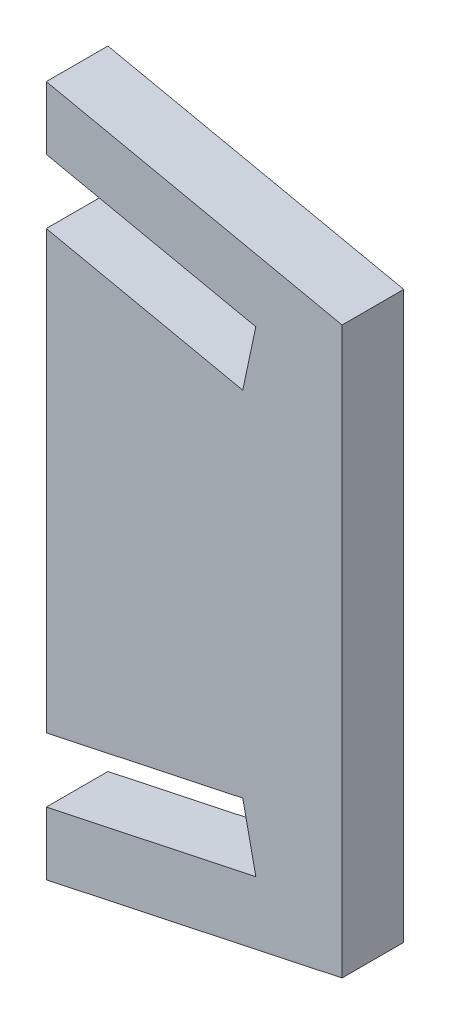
ISO-10303-21;
HEADER;
FILE_DESCRIPTION(('STEP AP214'),'2;1');
FILE_NAME('part.step','',(''),(''),'','','');
FILE_SCHEMA(('AUTOMOTIVE_DESIGN { 1 0 10303 214 1 1 1 1 }'));
ENDSEC;
DATA;
#1=APPLICATION_CONTEXT('core data for automotive mechanical design processes');
#2=APPLICATION_PROTOCOL_DEFINITION('international standard','automotive_design',2000,#1);
#3=PRODUCT_CONTEXT('',#1,'mechanical');
#4=PRODUCT('Part','Part','',(#3));
#5=PRODUCT_RELATED_PRODUCT_CATEGORY('part','',(#4));
#6=PRODUCT_DEFINITION_FORMATION('','',#4);
#7=PRODUCT_DEFINITION_CONTEXT('part definition',#1,'design');
#8=PRODUCT_DEFINITION('design','',#6,#7);
#9=PRODUCT_DEFINITION_SHAPE('','',#8);
#10=(LENGTH_UNIT() NAMED_UNIT(*) SI_UNIT(.MILLI.,.METRE.));
#11=(NAMED_UNIT(*) PLANE_ANGLE_UNIT() SI_UNIT($,.RADIAN.));
#12=(NAMED_UNIT(*) SI_UNIT($,.STERADIAN.) SOLID_ANGLE_UNIT());
#13=UNCERTAINTY_MEASURE_WITH_UNIT(LENGTH_MEASURE(1.E-05),#10,'distance_accuracy_value','');
#14=(GEOMETRIC_REPRESENTATION_CONTEXT(3) GLOBAL_UNCERTAINTY_ASSIGNED_CONTEXT((#13)) GLOBAL_UNIT_ASSIGNED_CONTEXT((#10,
#11,#12)) REPRESENTATION_CONTEXT('',''));
#15=CARTESIAN_POINT('',(0.,0.,0.));
#16=DIRECTION('',(0.,0.,1.));
#17=DIRECTION('',(1.,0.,0.));
#18=AXIS2_PLACEMENT_3D('',#15,#16,#17);
#19=CARTESIAN_POINT('',(-48.,0.,10.));
#20=DIRECTION('',(1.,0.,0.));
#21=DIRECTION('',(0.,0.,-1.));
#22=AXIS2_PLACEMENT_3D('',#19,#20,#21);
#23=PLANE('',#22);
#24=DIRECTION('',(0.,-1.,0.));
#25=VECTOR('',#24,1.);
#26=CARTESIAN_POINT('',(-48.,0.,10.));
#27=LINE('',#26,#25);
#28=CARTESIAN_POINT('',(-48.,121.087434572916,10.));
#29=VERTEX_POINT('',#28);
#30=CARTESIAN_POINT('',(-48.,110.864028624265,10.));
#31=VERTEX_POINT('',#30);
#32=EDGE_CURVE('E41',#29,#31,#27,.T.);
#33=ORIENTED_EDGE('',*,*,#32,.F.);
#34=DIRECTION('',(0.,0.,-1.));
#35=VECTOR('',#34,1.);
#36=CARTESIAN_POINT('',(-48.,121.087434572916,10.));
#37=LINE('',#36,#35);
#38=CARTESIAN_POINT('',(-48.,121.087434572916,0.));
#39=VERTEX_POINT('',#38);
#40=EDGE_CURVE('E122',#29,#39,#37,.T.);
#41=ORIENTED_EDGE('',*,*,#40,.T.);
#42=DIRECTION('',(0.,-1.,0.));
#43=VECTOR('',#42,1.);
#44=CARTESIAN_POINT('',(-48.,0.,0.));
#45=LINE('',#44,#43);
#46=CARTESIAN_POINT('',(-48.,110.864028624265,0.));
#47=VERTEX_POINT('',#46);
#48=EDGE_CURVE('E141',#39,#47,#45,.T.);
#49=ORIENTED_EDGE('',*,*,#48,.T.);
#50=DIRECTION('',(0.,0.,1.));
#51=VECTOR('',#50,1.);
#52=CARTESIAN_POINT('',(-48.,110.864028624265,0.));
#53=LINE('',#52,#51);
#54=EDGE_CURVE('E151',#47,#31,#53,.T.);
#55=ORIENTED_EDGE('',*,*,#54,.T.);
#56=EDGE_LOOP('',(#33,#41,#49,#55));
#57=FACE_BOUND('',#56,.T.);
#58=ADVANCED_FACE('F33',(#57),#23,.F.);
#59=CARTESIAN_POINT('',(-48.,100.436154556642,10.));
#60=VERTEX_POINT('',#59);
#61=CARTESIAN_POINT('',(-48.,29.563845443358,10.));
#62=VERTEX_POINT('',#61);
#63=EDGE_CURVE('E143',#60,#62,#27,.T.);
#64=ORIENTED_EDGE('',*,*,#63,.F.);
#65=DIRECTION('',(0.,0.,1.));
#66=VECTOR('',#65,1.);
#67=CARTESIAN_POINT('',(-48.,100.436154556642,0.));
#68=LINE('',#67,#66);
#69=CARTESIAN_POINT('',(-48.,100.436154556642,0.));
#70=VERTEX_POINT('',#69);
#71=EDGE_CURVE('E165',#70,#60,#68,.T.);
#72=ORIENTED_EDGE('',*,*,#71,.F.);
#73=CARTESIAN_POINT('',(-48.,29.563845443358,0.));
#74=VERTEX_POINT('',#73);
#75=EDGE_CURVE('E145',#70,#74,#45,.T.);
#76=ORIENTED_EDGE('',*,*,#75,.T.);
#77=DIRECTION('',(0.,0.,1.));
#78=VECTOR('',#77,1.);
#79=CARTESIAN_POINT('',(-48.,29.563845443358,0.));
#80=LINE('',#79,#78);
#81=EDGE_CURVE('E148',#74,#62,#80,.T.);
#82=ORIENTED_EDGE('',*,*,#81,.T.);
#83=EDGE_LOOP('',(#64,#72,#76,#82));
#84=FACE_BOUND('',#83,.T.);
#85=ADVANCED_FACE('F198',(#84),#23,.F.);
#86=CARTESIAN_POINT('',(0.,0.,10.));
#87=DIRECTION('',(-1.,0.,0.));
#88=DIRECTION('',(0.,-1.,0.));
#89=AXIS2_PLACEMENT_3D('',#86,#87,#88);
#90=PLANE('',#89);
#91=DIRECTION('',(0.,1.,0.));
#92=VECTOR('',#91,1.);
#93=CARTESIAN_POINT('',(0.,0.,0.));
#94=LINE('',#93,#92);
#95=CARTESIAN_POINT('',(0.,19.1152803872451,0.));
#96=VERTEX_POINT('',#95);
#97=CARTESIAN_POINT('',(0.,110.884719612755,0.));
#98=VERTEX_POINT('',#97);
#99=EDGE_CURVE('E134',#96,#98,#94,.T.);
#100=ORIENTED_EDGE('',*,*,#99,.T.);
#101=DIRECTION('',(0.,0.,1.));
#102=VECTOR('',#101,1.);
#103=CARTESIAN_POINT('',(0.,110.884719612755,0.));
#104=LINE('',#103,#102);
#105=CARTESIAN_POINT('',(0.,110.884719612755,10.));
#106=VERTEX_POINT('',#105);
#107=EDGE_CURVE('E56',#98,#106,#104,.T.);
#108=ORIENTED_EDGE('',*,*,#107,.T.);
#109=DIRECTION('',(0.,1.,0.));
#110=VECTOR('',#109,1.);
#111=CARTESIAN_POINT('',(0.,0.,10.));
#112=LINE('',#111,#110);
#113=CARTESIAN_POINT('',(0.,19.1152803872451,10.));
#114=VERTEX_POINT('',#113);
#115=EDGE_CURVE('E132',#114,#106,#112,.T.);
#116=ORIENTED_EDGE('',*,*,#115,.F.);
#117=DIRECTION('',(0.,0.,1.));
#118=VECTOR('',#117,1.);
#119=CARTESIAN_POINT('',(0.,19.1152803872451,0.));
#120=LINE('',#119,#118);
#121=EDGE_CURVE('E126',#96,#114,#120,.T.);
#122=ORIENTED_EDGE('',*,*,#121,.F.);
#123=EDGE_LOOP('',(#100,#108,#116,#122));
#124=FACE_BOUND('',#123,.T.);
#125=ADVANCED_FACE('F35',(#124),#90,.F.);
#126=CARTESIAN_POINT('',(-48.,19.1359713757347,0.));
#127=VERTEX_POINT('',#126);
#128=CARTESIAN_POINT('',(-48.,8.91256542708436,0.));
#129=VERTEX_POINT('',#128);
#130=EDGE_CURVE('E146',#127,#129,#45,.T.);
#131=ORIENTED_EDGE('',*,*,#130,.T.);
#132=DIRECTION('',(0.,0.,1.));
#133=VECTOR('',#132,1.);
#134=CARTESIAN_POINT('',(-48.,8.91256542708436,10.));
#135=LINE('',#134,#133);
#136=CARTESIAN_POINT('',(-48.,8.91256542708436,10.));
#137=VERTEX_POINT('',#136);
#138=EDGE_CURVE('E48',#129,#137,#135,.T.);
#139=ORIENTED_EDGE('',*,*,#138,.T.);
#140=CARTESIAN_POINT('',(-48.,19.1359713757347,10.));
#141=VERTEX_POINT('',#140);
#142=EDGE_CURVE('E140',#141,#137,#27,.T.);
#143=ORIENTED_EDGE('',*,*,#142,.F.);
#144=DIRECTION('',(0.,0.,1.));
#145=VECTOR('',#144,1.);
#146=CARTESIAN_POINT('',(-48.,19.1359713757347,0.));
#147=LINE('',#146,#145);
#148=EDGE_CURVE('E189',#127,#141,#147,.T.);
#149=ORIENTED_EDGE('',*,*,#148,.F.);
#150=EDGE_LOOP('',(#131,#139,#143,#149));
#151=FACE_BOUND('',#150,.T.);
#152=ADVANCED_FACE('F233',(#151),#23,.F.);
#153=CARTESIAN_POINT('',(0.,0.,10.));
#154=DIRECTION('',(0.,0.,1.));
#155=DIRECTION('',(1.,0.,0.));
#156=AXIS2_PLACEMENT_3D('',#153,#154,#155);
#157=PLANE('',#156);
#158=DIRECTION('',(0.978147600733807,-0.207911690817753,0.));
#159=VECTOR('',#158,1.);
#160=CARTESIAN_POINT('',(-89.9303236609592,130.,10.));
#161=LINE('',#160,#159);
#162=EDGE_CURVE('E119',#29,#106,#161,.T.);
#163=ORIENTED_EDGE('',*,*,#162,.F.);
#164=ORIENTED_EDGE('',*,*,#32,.T.);
#165=DIRECTION('',(-0.978147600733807,0.207911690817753,0.));
#166=VECTOR('',#165,1.);
#167=CARTESIAN_POINT('',(-48.,110.864028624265,10.));
#168=LINE('',#167,#166);
#169=CARTESIAN_POINT('',(-14.,103.637105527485,10.));
#170=VERTEX_POINT('',#169);
#171=EDGE_CURVE('E161',#170,#31,#168,.T.);
#172=ORIENTED_EDGE('',*,*,#171,.F.);
#173=DIRECTION('',(0.207911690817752,0.978147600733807,0.));
#174=VECTOR('',#173,1.);
#175=CARTESIAN_POINT('',(-14.,103.637105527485,10.));
#176=LINE('',#175,#174);
#177=CARTESIAN_POINT('',(-16.1206992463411,93.66,10.));
#178=VERTEX_POINT('',#177);
#179=EDGE_CURVE('E210',#178,#170,#176,.T.);
#180=ORIENTED_EDGE('',*,*,#179,.F.);
#181=DIRECTION('',(0.978147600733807,-0.207911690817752,0.));
#182=VECTOR('',#181,1.);
#183=CARTESIAN_POINT('',(-16.1206992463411,93.66,10.));
#184=LINE('',#183,#182);
#185=EDGE_CURVE('E187',#60,#178,#184,.T.);
#186=ORIENTED_EDGE('',*,*,#185,.F.);
#187=ORIENTED_EDGE('',*,*,#63,.T.);
#188=DIRECTION('',(-0.978147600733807,-0.207911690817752,0.));
#189=VECTOR('',#188,1.);
#190=CARTESIAN_POINT('',(-16.1206992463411,36.34,10.));
#191=LINE('',#190,#189);
#192=CARTESIAN_POINT('',(-16.1206992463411,36.34,10.));
#193=VERTEX_POINT('',#192);
#194=EDGE_CURVE('E178',#193,#62,#191,.T.);
#195=ORIENTED_EDGE('',*,*,#194,.F.);
#196=DIRECTION('',(-0.207911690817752,0.978147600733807,0.));
#197=VECTOR('',#196,1.);
#198=CARTESIAN_POINT('',(-14.,26.3628944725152,10.));
#199=LINE('',#198,#197);
#200=CARTESIAN_POINT('',(-14.,26.3628944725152,10.));
#201=VERTEX_POINT('',#200);
#202=EDGE_CURVE('E172',#201,#193,#199,.T.);
#203=ORIENTED_EDGE('',*,*,#202,.F.);
#204=DIRECTION('',(0.978147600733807,0.207911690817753,0.));
#205=VECTOR('',#204,1.);
#206=CARTESIAN_POINT('',(-48.,19.1359713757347,10.));
#207=LINE('',#206,#205);
#208=EDGE_CURVE('E180',#141,#201,#207,.T.);
#209=ORIENTED_EDGE('',*,*,#208,.F.);
#210=ORIENTED_EDGE('',*,*,#142,.T.);
#211=DIRECTION('',(-0.978147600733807,-0.207911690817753,0.));
#212=VECTOR('',#211,1.);
#213=CARTESIAN_POINT('',(-89.9303236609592,0.,10.));
#214=LINE('',#213,#212);
#215=EDGE_CURVE('E139',#114,#137,#214,.T.);
#216=ORIENTED_EDGE('',*,*,#215,.F.);
#217=ORIENTED_EDGE('',*,*,#115,.T.);
#218=EDGE_LOOP('',(#163,#164,#172,#180,#186,#187,#195,#203,#209,#210,#216,#217));
#219=FACE_BOUND('',#218,.T.);
#220=ADVANCED_FACE('F137',(#219),#157,.T.);
#221=CARTESIAN_POINT('',(0.,0.,0.));
#222=DIRECTION('',(0.,0.,1.));
#223=DIRECTION('',(1.,0.,0.));
#224=AXIS2_PLACEMENT_3D('',#221,#222,#223);
#225=PLANE('',#224);
#226=ORIENTED_EDGE('',*,*,#48,.F.);
#227=DIRECTION('',(0.978147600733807,-0.207911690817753,0.));
#228=VECTOR('',#227,1.);
#229=CARTESIAN_POINT('',(22.5504393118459,106.091475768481,0.));
#230=LINE('',#229,#228);
#231=EDGE_CURVE('E11',#39,#98,#230,.T.);
#232=ORIENTED_EDGE('',*,*,#231,.T.);
#233=ORIENTED_EDGE('',*,*,#99,.F.);
#234=DIRECTION('',(-0.978147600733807,-0.207911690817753,0.));
#235=VECTOR('',#234,1.);
#236=CARTESIAN_POINT('',(-89.9303236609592,0.,0.));
#237=LINE('',#236,#235);
#238=EDGE_CURVE('E226',#96,#129,#237,.T.);
#239=ORIENTED_EDGE('',*,*,#238,.T.);
#240=ORIENTED_EDGE('',*,*,#130,.F.);
#241=DIRECTION('',(0.978147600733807,0.207911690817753,0.));
#242=VECTOR('',#241,1.);
#243=CARTESIAN_POINT('',(-48.,19.1359713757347,0.));
#244=LINE('',#243,#242);
#245=CARTESIAN_POINT('',(-14.,26.3628944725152,0.));
#246=VERTEX_POINT('',#245);
#247=EDGE_CURVE('E171',#127,#246,#244,.T.);
#248=ORIENTED_EDGE('',*,*,#247,.T.);
#249=DIRECTION('',(-0.207911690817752,0.978147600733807,0.));
#250=VECTOR('',#249,1.);
#251=CARTESIAN_POINT('',(-14.,26.3628944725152,0.));
#252=LINE('',#251,#250);
#253=CARTESIAN_POINT('',(-16.1206992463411,36.34,0.));
#254=VERTEX_POINT('',#253);
#255=EDGE_CURVE('E175',#246,#254,#252,.T.);
#256=ORIENTED_EDGE('',*,*,#255,.T.);
#257=DIRECTION('',(-0.978147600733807,-0.207911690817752,0.));
#258=VECTOR('',#257,1.);
#259=CARTESIAN_POINT('',(-16.1206992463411,36.34,0.));
#260=LINE('',#259,#258);
#261=EDGE_CURVE('E168',#254,#74,#260,.T.);
#262=ORIENTED_EDGE('',*,*,#261,.T.);
#263=ORIENTED_EDGE('',*,*,#75,.F.);
#264=DIRECTION('',(0.978147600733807,-0.207911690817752,0.));
#265=VECTOR('',#264,1.);
#266=CARTESIAN_POINT('',(-16.1206992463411,93.66,0.));
#267=LINE('',#266,#265);
#268=CARTESIAN_POINT('',(-16.1206992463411,93.66,0.));
#269=VERTEX_POINT('',#268);
#270=EDGE_CURVE('E220',#70,#269,#267,.T.);
#271=ORIENTED_EDGE('',*,*,#270,.T.);
#272=DIRECTION('',(0.207911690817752,0.978147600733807,0.));
#273=VECTOR('',#272,1.);
#274=CARTESIAN_POINT('',(-14.,103.637105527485,0.));
#275=LINE('',#274,#273);
#276=CARTESIAN_POINT('',(-14.,103.637105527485,0.));
#277=VERTEX_POINT('',#276);
#278=EDGE_CURVE('E217',#269,#277,#275,.T.);
#279=ORIENTED_EDGE('',*,*,#278,.T.);
#280=DIRECTION('',(-0.978147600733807,0.207911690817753,0.));
#281=VECTOR('',#280,1.);
#282=CARTESIAN_POINT('',(-48.,110.864028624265,0.));
#283=LINE('',#282,#281);
#284=EDGE_CURVE('E167',#277,#47,#283,.T.);
#285=ORIENTED_EDGE('',*,*,#284,.T.);
#286=EDGE_LOOP('',(#226,#232,#233,#239,#240,#248,#256,#262,#263,#271,#279,#285));
#287=FACE_BOUND('',#286,.T.);
#288=ADVANCED_FACE('F231',(#287),#225,.F.);
#289=CARTESIAN_POINT('',(-16.1206992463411,36.34,0.));
#290=DIRECTION('',(-0.207911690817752,0.978147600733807,0.));
#291=DIRECTION('',(-0.978147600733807,-0.207911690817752,0.));
#292=AXIS2_PLACEMENT_3D('',#289,#290,#291);
#293=PLANE('',#292);
#294=ORIENTED_EDGE('',*,*,#194,.T.);
#295=ORIENTED_EDGE('',*,*,#81,.F.);
#296=ORIENTED_EDGE('',*,*,#261,.F.);
#297=DIRECTION('',(0.,0.,1.));
#298=VECTOR('',#297,1.);
#299=CARTESIAN_POINT('',(-16.1206992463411,36.34,0.));
#300=LINE('',#299,#298);
#301=EDGE_CURVE('E185',#254,#193,#300,.T.);
#302=ORIENTED_EDGE('',*,*,#301,.T.);
#303=EDGE_LOOP('',(#294,#295,#296,#302));
#304=FACE_BOUND('',#303,.T.);
#305=ADVANCED_FACE('F239',(#304),#293,.F.);
#306=CARTESIAN_POINT('',(-14.,26.3628944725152,0.));
#307=DIRECTION('',(0.978147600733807,0.207911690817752,0.));
#308=DIRECTION('',(-0.207911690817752,0.978147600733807,0.));
#309=AXIS2_PLACEMENT_3D('',#306,#307,#308);
#310=PLANE('',#309);
#311=ORIENTED_EDGE('',*,*,#202,.T.);
#312=ORIENTED_EDGE('',*,*,#301,.F.);
#313=ORIENTED_EDGE('',*,*,#255,.F.);
#314=DIRECTION('',(0.,0.,1.));
#315=VECTOR('',#314,1.);
#316=CARTESIAN_POINT('',(-14.,26.3628944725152,0.));
#317=LINE('',#316,#315);
#318=EDGE_CURVE('E188',#246,#201,#317,.T.);
#319=ORIENTED_EDGE('',*,*,#318,.T.);
#320=EDGE_LOOP('',(#311,#312,#313,#319));
#321=FACE_BOUND('',#320,.T.);
#322=ADVANCED_FACE('F238',(#321),#310,.F.);
#323=CARTESIAN_POINT('',(-48.,19.1359713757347,0.));
#324=DIRECTION('',(0.207911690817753,-0.978147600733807,0.));
#325=DIRECTION('',(0.978147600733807,0.207911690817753,0.));
#326=AXIS2_PLACEMENT_3D('',#323,#324,#325);
#327=PLANE('',#326);
#328=ORIENTED_EDGE('',*,*,#208,.T.);
#329=ORIENTED_EDGE('',*,*,#318,.F.);
#330=ORIENTED_EDGE('',*,*,#247,.F.);
#331=ORIENTED_EDGE('',*,*,#148,.T.);
#332=EDGE_LOOP('',(#328,#329,#330,#331));
#333=FACE_BOUND('',#332,.T.);
#334=ADVANCED_FACE('F236',(#333),#327,.F.);
#335=CARTESIAN_POINT('',(-48.,110.864028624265,0.));
#336=DIRECTION('',(0.207911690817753,0.978147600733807,0.));
#337=DIRECTION('',(-0.978147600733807,0.207911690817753,0.));
#338=AXIS2_PLACEMENT_3D('',#335,#336,#337);
#339=PLANE('',#338);
#340=ORIENTED_EDGE('',*,*,#171,.T.);
#341=ORIENTED_EDGE('',*,*,#54,.F.);
#342=ORIENTED_EDGE('',*,*,#284,.F.);
#343=DIRECTION('',(0.,0.,1.));
#344=VECTOR('',#343,1.);
#345=CARTESIAN_POINT('',(-14.,103.637105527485,0.));
#346=LINE('',#345,#344);
#347=EDGE_CURVE('E154',#277,#170,#346,.T.);
#348=ORIENTED_EDGE('',*,*,#347,.T.);
#349=EDGE_LOOP('',(#340,#341,#342,#348));
#350=FACE_BOUND('',#349,.T.);
#351=ADVANCED_FACE('F286',(#350),#339,.F.);
#352=CARTESIAN_POINT('',(-14.,103.637105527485,0.));
#353=DIRECTION('',(0.978147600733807,-0.207911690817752,0.));
#354=DIRECTION('',(0.207911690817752,0.978147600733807,0.));
#355=AXIS2_PLACEMENT_3D('',#352,#353,#354);
#356=PLANE('',#355);
#357=ORIENTED_EDGE('',*,*,#179,.T.);
#358=ORIENTED_EDGE('',*,*,#347,.F.);
#359=ORIENTED_EDGE('',*,*,#278,.F.);
#360=DIRECTION('',(0.,0.,1.));
#361=VECTOR('',#360,1.);
#362=CARTESIAN_POINT('',(-16.1206992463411,93.66,0.));
#363=LINE('',#362,#361);
#364=EDGE_CURVE('E158',#269,#178,#363,.T.);
#365=ORIENTED_EDGE('',*,*,#364,.T.);
#366=EDGE_LOOP('',(#357,#358,#359,#365));
#367=FACE_BOUND('',#366,.T.);
#368=ADVANCED_FACE('F294',(#367),#356,.F.);
#369=CARTESIAN_POINT('',(-16.1206992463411,93.66,0.));
#370=DIRECTION('',(-0.207911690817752,-0.978147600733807,0.));
#371=DIRECTION('',(0.978147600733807,-0.207911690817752,0.));
#372=AXIS2_PLACEMENT_3D('',#369,#370,#371);
#373=PLANE('',#372);
#374=ORIENTED_EDGE('',*,*,#185,.T.);
#375=ORIENTED_EDGE('',*,*,#364,.F.);
#376=ORIENTED_EDGE('',*,*,#270,.F.);
#377=ORIENTED_EDGE('',*,*,#71,.T.);
#378=EDGE_LOOP('',(#374,#375,#376,#377));
#379=FACE_BOUND('',#378,.T.);
#380=ADVANCED_FACE('F304',(#379),#373,.F.);
#381=CARTESIAN_POINT('',(-89.9303236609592,0.,0.));
#382=DIRECTION('',(-0.207911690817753,0.978147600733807,0.));
#383=DIRECTION('',(-0.978147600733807,-0.207911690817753,0.));
#384=AXIS2_PLACEMENT_3D('',#381,#382,#383);
#385=PLANE('',#384);
#386=ORIENTED_EDGE('',*,*,#238,.F.);
#387=ORIENTED_EDGE('',*,*,#121,.T.);
#388=ORIENTED_EDGE('',*,*,#215,.T.);
#389=ORIENTED_EDGE('',*,*,#138,.F.);
#390=EDGE_LOOP('',(#386,#387,#388,#389));
#391=FACE_BOUND('',#390,.T.);
#392=ADVANCED_FACE('F313',(#391),#385,.F.);
#393=CARTESIAN_POINT('',(-89.9303236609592,130.,0.));
#394=DIRECTION('',(-0.207911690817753,-0.978147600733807,0.));
#395=DIRECTION('',(0.978147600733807,-0.207911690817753,0.));
#396=AXIS2_PLACEMENT_3D('',#393,#394,#395);
#397=PLANE('',#396);
#398=ORIENTED_EDGE('',*,*,#162,.T.);
#399=ORIENTED_EDGE('',*,*,#107,.F.);
#400=ORIENTED_EDGE('',*,*,#231,.F.);
#401=ORIENTED_EDGE('',*,*,#40,.F.);
#402=EDGE_LOOP('',(#398,#399,#400,#401));
#403=FACE_BOUND('',#402,.T.);
#404=ADVANCED_FACE('F120',(#403),#397,.F.);
#405=CLOSED_SHELL('',(#58,#85,#125,#152,#220,#288,#305,#322,#334,#351,#368,#380,#392,#404));
#406=MANIFOLD_SOLID_BREP('B2',#405);
#407=ADVANCED_BREP_SHAPE_REPRESENTATION('',(#18,#406),#14);
#408=SHAPE_DEFINITION_REPRESENTATION(#9,#407);
ENDSEC;
END-ISO-10303-21;
